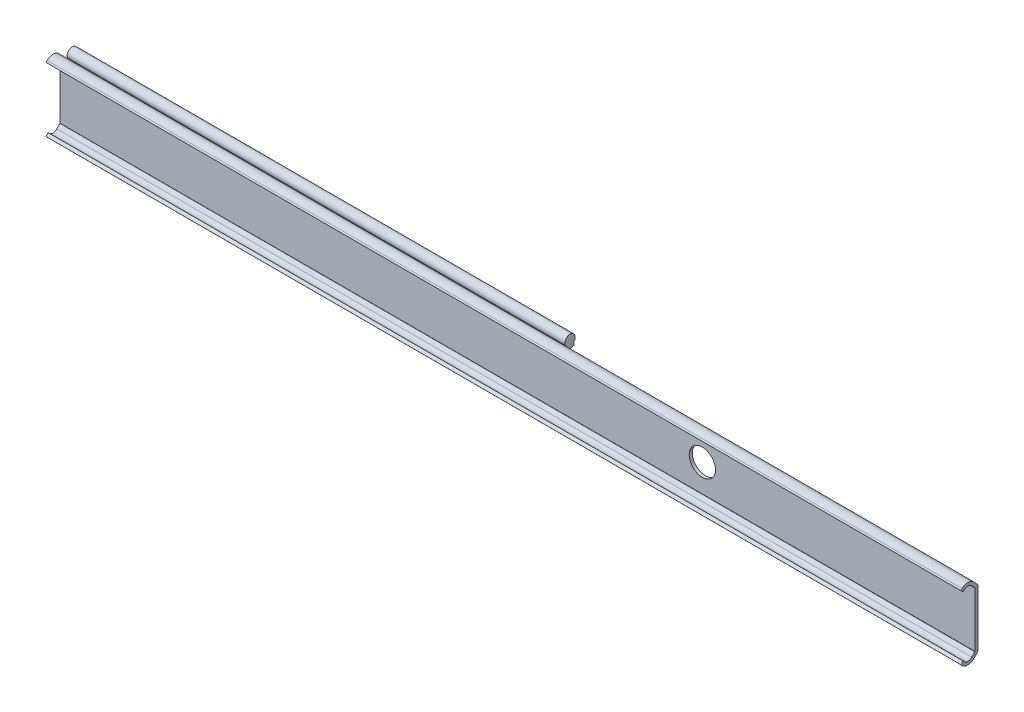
ISO-10303-21;
HEADER;
FILE_DESCRIPTION(('STEP AP214'),'2;1');
FILE_NAME('part.step','',(''),(''),'','','');
FILE_SCHEMA(('AUTOMOTIVE_DESIGN { 1 0 10303 214 1 1 1 1 }'));
ENDSEC;
DATA;
#1=APPLICATION_CONTEXT('core data for automotive mechanical design processes');
#2=APPLICATION_PROTOCOL_DEFINITION('international standard','automotive_design',2000,#1);
#3=PRODUCT_CONTEXT('',#1,'mechanical');
#4=PRODUCT('Part','Part','',(#3));
#5=PRODUCT_RELATED_PRODUCT_CATEGORY('part','',(#4));
#6=PRODUCT_DEFINITION_FORMATION('','',#4);
#7=PRODUCT_DEFINITION_CONTEXT('part definition',#1,'design');
#8=PRODUCT_DEFINITION('design','',#6,#7);
#9=PRODUCT_DEFINITION_SHAPE('','',#8);
#10=(LENGTH_UNIT() NAMED_UNIT(*) SI_UNIT(.MILLI.,.METRE.));
#11=(NAMED_UNIT(*) PLANE_ANGLE_UNIT() SI_UNIT($,.RADIAN.));
#12=(NAMED_UNIT(*) SI_UNIT($,.STERADIAN.) SOLID_ANGLE_UNIT());
#13=UNCERTAINTY_MEASURE_WITH_UNIT(LENGTH_MEASURE(1.E-05),#10,'distance_accuracy_value','');
#14=(GEOMETRIC_REPRESENTATION_CONTEXT(3) GLOBAL_UNCERTAINTY_ASSIGNED_CONTEXT((#13)) GLOBAL_UNIT_ASSIGNED_CONTEXT((#10,
#11,#12)) REPRESENTATION_CONTEXT('',''));
#15=CARTESIAN_POINT('',(0.,0.,0.));
#16=DIRECTION('',(0.,0.,1.));
#17=DIRECTION('',(1.,0.,0.));
#18=AXIS2_PLACEMENT_3D('',#15,#16,#17);
#19=CARTESIAN_POINT('',(0.,-13.5610180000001,0.));
#20=DIRECTION('',(0.,0.,-1.));
#21=DIRECTION('',(1.,0.,0.));
#22=AXIS2_PLACEMENT_3D('',#19,#20,#21);
#23=PLANE('',#22);
#24=CARTESIAN_POINT('',(318.2,0.,0.));
#25=DIRECTION('',(0.,0.,1.));
#26=DIRECTION('',(0.,-1.,0.));
#27=AXIS2_PLACEMENT_3D('',#24,#25,#26);
#28=CIRCLE('',#27,6.5);
#29=CARTESIAN_POINT('',(318.2,-6.50000000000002,0.));
#30=VERTEX_POINT('',#29);
#31=EDGE_CURVE('E9',#30,#30,#28,.T.);
#32=ORIENTED_EDGE('',*,*,#31,.T.);
#33=EDGE_LOOP('',(#32));
#34=FACE_BOUND('',#33,.T.);
#35=DIRECTION('',(0.,1.,0.));
#36=VECTOR('',#35,1.);
#37=CARTESIAN_POINT('',(0.,-13.5610180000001,0.));
#38=LINE('',#37,#36);
#39=CARTESIAN_POINT('',(0.,-13.5610180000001,0.));
#40=VERTEX_POINT('',#39);
#41=CARTESIAN_POINT('',(0.,-10.7622239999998,0.));
#42=VERTEX_POINT('',#41);
#43=EDGE_CURVE('E471',#40,#42,#38,.T.);
#44=ORIENTED_EDGE('',*,*,#43,.T.);
#45=DIRECTION('',(1.,0.,0.));
#46=VECTOR('',#45,1.);
#47=CARTESIAN_POINT('',(0.,-10.7622239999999,0.));
#48=LINE('',#47,#46);
#49=CARTESIAN_POINT('',(246.6,-10.7622239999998,0.));
#50=VERTEX_POINT('',#49);
#51=EDGE_CURVE('E23',#42,#50,#48,.T.);
#52=ORIENTED_EDGE('',*,*,#51,.T.);
#53=DIRECTION('',(0.,1.,0.));
#54=VECTOR('',#53,1.);
#55=CARTESIAN_POINT('',(246.6,-25.,0.));
#56=LINE('',#55,#54);
#57=CARTESIAN_POINT('',(246.6,10.7622239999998,0.));
#58=VERTEX_POINT('',#57);
#59=EDGE_CURVE('E302',#50,#58,#56,.T.);
#60=ORIENTED_EDGE('',*,*,#59,.T.);
#61=DIRECTION('',(1.,0.,0.));
#62=VECTOR('',#61,1.);
#63=CARTESIAN_POINT('',(0.,10.7622239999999,0.));
#64=LINE('',#63,#62);
#65=CARTESIAN_POINT('',(0.,10.7622239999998,0.));
#66=VERTEX_POINT('',#65);
#67=EDGE_CURVE('E31',#66,#58,#64,.T.);
#68=ORIENTED_EDGE('',*,*,#67,.F.);
#69=CARTESIAN_POINT('',(0.,13.561018,0.));
#70=VERTEX_POINT('',#69);
#71=EDGE_CURVE('E470',#66,#70,#38,.T.);
#72=ORIENTED_EDGE('',*,*,#71,.T.);
#73=DIRECTION('',(1.,0.,0.));
#74=VECTOR('',#73,1.);
#75=CARTESIAN_POINT('',(0.,13.561018,0.));
#76=LINE('',#75,#74);
#77=CARTESIAN_POINT('',(453.2,13.561018,0.));
#78=VERTEX_POINT('',#77);
#79=EDGE_CURVE('E482',#70,#78,#76,.T.);
#80=ORIENTED_EDGE('',*,*,#79,.T.);
#81=DIRECTION('',(0.,1.,0.));
#82=VECTOR('',#81,1.);
#83=CARTESIAN_POINT('',(453.2,-13.5610180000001,0.));
#84=LINE('',#83,#82);
#85=CARTESIAN_POINT('',(453.2,-13.5610180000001,0.));
#86=VERTEX_POINT('',#85);
#87=EDGE_CURVE('E410',#86,#78,#84,.T.);
#88=ORIENTED_EDGE('',*,*,#87,.F.);
#89=DIRECTION('',(1.,0.,0.));
#90=VECTOR('',#89,1.);
#91=CARTESIAN_POINT('',(0.,-13.5610180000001,0.));
#92=LINE('',#91,#90);
#93=EDGE_CURVE('E484',#40,#86,#92,.T.);
#94=ORIENTED_EDGE('',*,*,#93,.F.);
#95=EDGE_LOOP('',(#44,#52,#60,#68,#72,#80,#88,#94));
#96=FACE_BOUND('',#95,.T.);
#97=ADVANCED_FACE('F14',(#34,#96),#23,.T.);
#98=CARTESIAN_POINT('',(0.,-10.7622239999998,-1.66));
#99=DIRECTION('',(1.,0.,0.));
#100=DIRECTION('',(0.,0.,1.));
#101=AXIS2_PLACEMENT_3D('',#98,#99,#100);
#102=CYLINDRICAL_SURFACE('',#101,1.66);
#103=DIRECTION('',(1.,0.,0.));
#104=VECTOR('',#103,1.);
#105=CARTESIAN_POINT('',(0.,-12.2669175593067,-2.36106867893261));
#106=LINE('',#105,#104);
#107=CARTESIAN_POINT('',(0.,-12.2669175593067,-2.36106867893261));
#108=VERTEX_POINT('',#107);
#109=CARTESIAN_POINT('',(246.6,-12.2669175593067,-2.36106867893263));
#110=VERTEX_POINT('',#109);
#111=EDGE_CURVE('E264',#108,#110,#106,.T.);
#112=ORIENTED_EDGE('',*,*,#111,.T.);
#113=CARTESIAN_POINT('',(246.6,-10.7622239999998,-1.66));
#114=DIRECTION('',(-1.,0.,0.));
#115=DIRECTION('',(0.,0.,1.));
#116=AXIS2_PLACEMENT_3D('',#113,#114,#115);
#117=CIRCLE('',#116,1.66);
#118=EDGE_CURVE('E327',#50,#110,#117,.F.);
#119=ORIENTED_EDGE('',*,*,#118,.F.);
#120=ORIENTED_EDGE('',*,*,#51,.F.);
#121=CARTESIAN_POINT('',(0.,-10.7622239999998,-1.66));
#122=DIRECTION('',(1.,0.,0.));
#123=DIRECTION('',(0.,0.,-1.));
#124=AXIS2_PLACEMENT_3D('',#121,#122,#123);
#125=CIRCLE('',#124,1.65999999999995);
#126=EDGE_CURVE('E250',#42,#108,#125,.T.);
#127=ORIENTED_EDGE('',*,*,#126,.T.);
#128=EDGE_LOOP('',(#112,#119,#120,#127));
#129=FACE_BOUND('',#128,.T.);
#130=ADVANCED_FACE('F633',(#129),#102,.T.);
#131=CARTESIAN_POINT('',(0.,10.7622239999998,-1.66));
#132=DIRECTION('',(1.,0.,0.));
#133=DIRECTION('',(0.,0.,1.));
#134=AXIS2_PLACEMENT_3D('',#131,#132,#133);
#135=CYLINDRICAL_SURFACE('',#134,1.66);
#136=CARTESIAN_POINT('',(246.6,10.7622239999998,-1.66));
#137=DIRECTION('',(-1.,0.,0.));
#138=DIRECTION('',(0.,0.,1.));
#139=AXIS2_PLACEMENT_3D('',#136,#137,#138);
#140=CIRCLE('',#139,1.66);
#141=CARTESIAN_POINT('',(246.6,12.2669175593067,-2.36106867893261));
#142=VERTEX_POINT('',#141);
#143=EDGE_CURVE('E325',#142,#58,#140,.F.);
#144=ORIENTED_EDGE('',*,*,#143,.F.);
#145=DIRECTION('',(1.,0.,0.));
#146=VECTOR('',#145,1.);
#147=CARTESIAN_POINT('',(0.,12.2669175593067,-2.36106867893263));
#148=LINE('',#147,#146);
#149=CARTESIAN_POINT('',(0.,12.2669175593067,-2.36106867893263));
#150=VERTEX_POINT('',#149);
#151=EDGE_CURVE('E303',#150,#142,#148,.T.);
#152=ORIENTED_EDGE('',*,*,#151,.F.);
#153=CARTESIAN_POINT('',(0.,10.7622239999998,-1.66));
#154=DIRECTION('',(1.,0.,0.));
#155=DIRECTION('',(0.,0.,-1.));
#156=AXIS2_PLACEMENT_3D('',#153,#154,#155);
#157=CIRCLE('',#156,1.65999999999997);
#158=EDGE_CURVE('E296',#150,#66,#157,.T.);
#159=ORIENTED_EDGE('',*,*,#158,.T.);
#160=ORIENTED_EDGE('',*,*,#67,.T.);
#161=EDGE_LOOP('',(#144,#152,#159,#160));
#162=FACE_BOUND('',#161,.T.);
#163=ADVANCED_FACE('F597',(#162),#135,.T.);
#164=CARTESIAN_POINT('',(0.,11.8784795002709,-5.98462837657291));
#165=DIRECTION('',(0.,0.60181512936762,-0.798635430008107));
#166=DIRECTION('',(0.,0.798635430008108,0.60181512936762));
#167=AXIS2_PLACEMENT_3D('',#164,#165,#166);
#168=PLANE('',#167);
#169=DIRECTION('',(1.,0.,0.));
#170=VECTOR('',#169,1.);
#171=CARTESIAN_POINT('',(0.,11.6159967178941,-6.18242339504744));
#172=LINE('',#171,#170);
#173=CARTESIAN_POINT('',(0.,11.6159967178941,-6.18242339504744));
#174=VERTEX_POINT('',#173);
#175=CARTESIAN_POINT('',(246.6,11.6159967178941,-6.18242339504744));
#176=VERTEX_POINT('',#175);
#177=EDGE_CURVE('E249',#174,#176,#172,.T.);
#178=ORIENTED_EDGE('',*,*,#177,.T.);
#179=DIRECTION('',(0.,0.798635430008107,0.60181512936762));
#180=VECTOR('',#179,1.);
#181=CARTESIAN_POINT('',(246.6,11.8784795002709,-5.98462837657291));
#182=LINE('',#181,#180);
#183=CARTESIAN_POINT('',(246.6,11.0618539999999,-6.6));
#184=VERTEX_POINT('',#183);
#185=EDGE_CURVE('E322',#184,#176,#182,.T.);
#186=ORIENTED_EDGE('',*,*,#185,.F.);
#187=DIRECTION('',(1.,0.,0.));
#188=VECTOR('',#187,1.);
#189=CARTESIAN_POINT('',(0.,11.0618539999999,-6.6));
#190=LINE('',#189,#188);
#191=CARTESIAN_POINT('',(0.,11.0618539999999,-6.6));
#192=VERTEX_POINT('',#191);
#193=EDGE_CURVE('E333',#192,#184,#190,.T.);
#194=ORIENTED_EDGE('',*,*,#193,.F.);
#195=DIRECTION('',(0.,0.798635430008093,0.601815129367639));
#196=VECTOR('',#195,1.);
#197=CARTESIAN_POINT('',(0.,11.0618539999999,-6.6));
#198=LINE('',#197,#196);
#199=EDGE_CURVE('E290',#192,#174,#198,.T.);
#200=ORIENTED_EDGE('',*,*,#199,.T.);
#201=EDGE_LOOP('',(#178,#186,#194,#200));
#202=FACE_BOUND('',#201,.T.);
#203=ADVANCED_FACE('F604',(#202),#168,.T.);
#204=CARTESIAN_POINT('',(0.,11.0618539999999,-6.6));
#205=DIRECTION('',(0.,0.,-1.));
#206=DIRECTION('',(1.,0.,0.));
#207=AXIS2_PLACEMENT_3D('',#204,#205,#206);
#208=PLANE('',#207);
#209=DIRECTION('',(0.,1.,0.));
#210=VECTOR('',#209,1.);
#211=CARTESIAN_POINT('',(246.6,11.0618539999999,-6.6));
#212=LINE('',#211,#210);
#213=CARTESIAN_POINT('',(246.6,10.4239399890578,-6.6));
#214=VERTEX_POINT('',#213);
#215=EDGE_CURVE('E320',#214,#184,#212,.T.);
#216=ORIENTED_EDGE('',*,*,#215,.F.);
#217=DIRECTION('',(1.,0.,0.));
#218=VECTOR('',#217,1.);
#219=CARTESIAN_POINT('',(0.,10.4239399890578,-6.6));
#220=LINE('',#219,#218);
#221=CARTESIAN_POINT('',(0.,10.4239399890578,-6.6));
#222=VERTEX_POINT('',#221);
#223=EDGE_CURVE('E336',#222,#214,#220,.T.);
#224=ORIENTED_EDGE('',*,*,#223,.F.);
#225=DIRECTION('',(0.,1.,0.));
#226=VECTOR('',#225,1.);
#227=CARTESIAN_POINT('',(0.,10.4239399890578,-6.6));
#228=LINE('',#227,#226);
#229=EDGE_CURVE('E287',#222,#192,#228,.T.);
#230=ORIENTED_EDGE('',*,*,#229,.T.);
#231=ORIENTED_EDGE('',*,*,#193,.T.);
#232=EDGE_LOOP('',(#216,#224,#230,#231));
#233=FACE_BOUND('',#232,.T.);
#234=ADVANCED_FACE('F608',(#233),#208,.T.);
#235=CARTESIAN_POINT('',(0.,13.915,-4.44999999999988));
#236=DIRECTION('',(1.,0.,0.));
#237=DIRECTION('',(0.,0.,1.));
#238=AXIS2_PLACEMENT_3D('',#235,#236,#237);
#239=CYLINDRICAL_SURFACE('',#238,4.1);
#240=CARTESIAN_POINT('',(246.6,13.915,-4.44999999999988));
#241=DIRECTION('',(-1.,0.,0.));
#242=DIRECTION('',(0.,0.,1.));
#243=AXIS2_PLACEMENT_3D('',#240,#241,#242);
#244=CIRCLE('',#243,4.1);
#245=CARTESIAN_POINT('',(246.6,10.8444026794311,-1.73312089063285));
#246=VERTEX_POINT('',#245);
#247=EDGE_CURVE('E318',#246,#214,#244,.F.);
#248=ORIENTED_EDGE('',*,*,#247,.F.);
#249=DIRECTION('',(1.,0.,0.));
#250=VECTOR('',#249,1.);
#251=CARTESIAN_POINT('',(0.,10.8444026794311,-1.73312089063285));
#252=LINE('',#251,#250);
#253=CARTESIAN_POINT('',(0.,10.8444026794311,-1.73312089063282));
#254=VERTEX_POINT('',#253);
#255=EDGE_CURVE('E339',#254,#246,#252,.T.);
#256=ORIENTED_EDGE('',*,*,#255,.F.);
#257=CARTESIAN_POINT('',(0.,13.915,-4.44999999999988));
#258=DIRECTION('',(1.,0.,0.));
#259=DIRECTION('',(0.,0.,-1.));
#260=AXIS2_PLACEMENT_3D('',#257,#258,#259);
#261=CIRCLE('',#260,4.1);
#262=EDGE_CURVE('E284',#254,#222,#261,.T.);
#263=ORIENTED_EDGE('',*,*,#262,.T.);
#264=ORIENTED_EDGE('',*,*,#223,.T.);
#265=EDGE_LOOP('',(#248,#256,#263,#264));
#266=FACE_BOUND('',#265,.T.);
#267=ADVANCED_FACE('F613',(#266),#239,.T.);
#268=CARTESIAN_POINT('',(0.,10.7622239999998,-1.66));
#269=DIRECTION('',(1.,0.,0.));
#270=DIRECTION('',(0.,0.,1.));
#271=AXIS2_PLACEMENT_3D('',#268,#269,#270);
#272=CYLINDRICAL_SURFACE('',#271,0.110000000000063);
#273=CARTESIAN_POINT('',(246.6,10.7622239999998,-1.66));
#274=DIRECTION('',(-1.,0.,0.));
#275=DIRECTION('',(0.,0.,1.));
#276=AXIS2_PLACEMENT_3D('',#273,#274,#275);
#277=CIRCLE('',#276,0.110000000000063);
#278=CARTESIAN_POINT('',(246.6,10.7622239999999,-1.55));
#279=VERTEX_POINT('',#278);
#280=EDGE_CURVE('E316',#279,#246,#277,.T.);
#281=ORIENTED_EDGE('',*,*,#280,.F.);
#282=DIRECTION('',(1.,0.,0.));
#283=VECTOR('',#282,1.);
#284=CARTESIAN_POINT('',(0.,10.7622239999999,-1.55));
#285=LINE('',#284,#283);
#286=CARTESIAN_POINT('',(0.,10.7622239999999,-1.55));
#287=VERTEX_POINT('',#286);
#288=EDGE_CURVE('E342',#287,#279,#285,.T.);
#289=ORIENTED_EDGE('',*,*,#288,.F.);
#290=CARTESIAN_POINT('',(0.,10.7622239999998,-1.66));
#291=DIRECTION('',(-1.,0.,0.));
#292=DIRECTION('',(0.,0.,-1.));
#293=AXIS2_PLACEMENT_3D('',#290,#291,#292);
#294=CIRCLE('',#293,0.110000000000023);
#295=EDGE_CURVE('E281',#287,#254,#294,.T.);
#296=ORIENTED_EDGE('',*,*,#295,.T.);
#297=ORIENTED_EDGE('',*,*,#255,.T.);
#298=EDGE_LOOP('',(#281,#289,#296,#297));
#299=FACE_BOUND('',#298,.T.);
#300=ADVANCED_FACE('F616',(#299),#272,.F.);
#301=CARTESIAN_POINT('',(0.,-10.7622239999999,-1.55));
#302=DIRECTION('',(0.,0.,-1.));
#303=DIRECTION('',(1.,0.,0.));
#304=AXIS2_PLACEMENT_3D('',#301,#302,#303);
#305=PLANE('',#304);
#306=DIRECTION('',(0.,1.,0.));
#307=VECTOR('',#306,1.);
#308=CARTESIAN_POINT('',(246.6,-10.7622239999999,-1.55));
#309=LINE('',#308,#307);
#310=CARTESIAN_POINT('',(246.6,-10.7622239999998,-1.54999999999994));
#311=VERTEX_POINT('',#310);
#312=EDGE_CURVE('E314',#311,#279,#309,.T.);
#313=ORIENTED_EDGE('',*,*,#312,.F.);
#314=DIRECTION('',(1.,0.,0.));
#315=VECTOR('',#314,1.);
#316=CARTESIAN_POINT('',(0.,-10.7622239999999,-1.55));
#317=LINE('',#316,#315);
#318=CARTESIAN_POINT('',(0.,-10.7622239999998,-1.55));
#319=VERTEX_POINT('',#318);
#320=EDGE_CURVE('E345',#319,#311,#317,.T.);
#321=ORIENTED_EDGE('',*,*,#320,.F.);
#322=DIRECTION('',(0.,1.,0.));
#323=VECTOR('',#322,1.);
#324=CARTESIAN_POINT('',(0.,-10.7622239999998,-1.54999999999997));
#325=LINE('',#324,#323);
#326=EDGE_CURVE('E278',#319,#287,#325,.T.);
#327=ORIENTED_EDGE('',*,*,#326,.T.);
#328=ORIENTED_EDGE('',*,*,#288,.T.);
#329=EDGE_LOOP('',(#313,#321,#327,#328));
#330=FACE_BOUND('',#329,.T.);
#331=ADVANCED_FACE('F621',(#330),#305,.T.);
#332=CARTESIAN_POINT('',(0.,-10.7622239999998,-1.66));
#333=DIRECTION('',(1.,0.,0.));
#334=DIRECTION('',(0.,0.,1.));
#335=AXIS2_PLACEMENT_3D('',#332,#333,#334);
#336=CYLINDRICAL_SURFACE('',#335,0.110000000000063);
#337=CARTESIAN_POINT('',(246.6,-10.7622239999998,-1.66));
#338=DIRECTION('',(-1.,0.,0.));
#339=DIRECTION('',(0.,0.,1.));
#340=AXIS2_PLACEMENT_3D('',#337,#338,#339);
#341=CIRCLE('',#340,0.110000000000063);
#342=CARTESIAN_POINT('',(246.6,-10.8444026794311,-1.73312089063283));
#343=VERTEX_POINT('',#342);
#344=EDGE_CURVE('E312',#343,#311,#341,.T.);
#345=ORIENTED_EDGE('',*,*,#344,.F.);
#346=DIRECTION('',(1.,0.,0.));
#347=VECTOR('',#346,1.);
#348=CARTESIAN_POINT('',(0.,-10.8444026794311,-1.73312089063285));
#349=LINE('',#348,#347);
#350=CARTESIAN_POINT('',(0.,-10.8444026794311,-1.73312089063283));
#351=VERTEX_POINT('',#350);
#352=EDGE_CURVE('E348',#351,#343,#349,.T.);
#353=ORIENTED_EDGE('',*,*,#352,.F.);
#354=CARTESIAN_POINT('',(0.,-10.7622239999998,-1.66));
#355=DIRECTION('',(-1.,0.,0.));
#356=DIRECTION('',(0.,0.,-1.));
#357=AXIS2_PLACEMENT_3D('',#354,#355,#356);
#358=CIRCLE('',#357,0.11000000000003);
#359=EDGE_CURVE('E275',#351,#319,#358,.T.);
#360=ORIENTED_EDGE('',*,*,#359,.T.);
#361=ORIENTED_EDGE('',*,*,#320,.T.);
#362=EDGE_LOOP('',(#345,#353,#360,#361));
#363=FACE_BOUND('',#362,.T.);
#364=ADVANCED_FACE('F624',(#363),#336,.F.);
#365=CARTESIAN_POINT('',(0.,-13.915,-4.44999999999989));
#366=DIRECTION('',(1.,0.,0.));
#367=DIRECTION('',(0.,0.,1.));
#368=AXIS2_PLACEMENT_3D('',#365,#366,#367);
#369=CYLINDRICAL_SURFACE('',#368,4.1);
#370=CARTESIAN_POINT('',(246.6,-13.915,-4.44999999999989));
#371=DIRECTION('',(-1.,0.,0.));
#372=DIRECTION('',(0.,0.,1.));
#373=AXIS2_PLACEMENT_3D('',#370,#371,#372);
#374=CIRCLE('',#373,4.1);
#375=CARTESIAN_POINT('',(246.6,-10.4239399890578,-6.6));
#376=VERTEX_POINT('',#375);
#377=EDGE_CURVE('E310',#376,#343,#374,.F.);
#378=ORIENTED_EDGE('',*,*,#377,.F.);
#379=DIRECTION('',(1.,0.,0.));
#380=VECTOR('',#379,1.);
#381=CARTESIAN_POINT('',(0.,-10.4239399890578,-6.6));
#382=LINE('',#381,#380);
#383=CARTESIAN_POINT('',(0.,-10.4239399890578,-6.6));
#384=VERTEX_POINT('',#383);
#385=EDGE_CURVE('E351',#384,#376,#382,.T.);
#386=ORIENTED_EDGE('',*,*,#385,.F.);
#387=CARTESIAN_POINT('',(0.,-13.915,-4.44999999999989));
#388=DIRECTION('',(1.,0.,0.));
#389=DIRECTION('',(0.,0.,-1.));
#390=AXIS2_PLACEMENT_3D('',#387,#388,#389);
#391=CIRCLE('',#390,4.1);
#392=EDGE_CURVE('E272',#384,#351,#391,.T.);
#393=ORIENTED_EDGE('',*,*,#392,.T.);
#394=ORIENTED_EDGE('',*,*,#352,.T.);
#395=EDGE_LOOP('',(#378,#386,#393,#394));
#396=FACE_BOUND('',#395,.T.);
#397=ADVANCED_FACE('F627',(#396),#369,.T.);
#398=CARTESIAN_POINT('',(0.,-11.0618539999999,-6.6));
#399=DIRECTION('',(0.,0.,-1.));
#400=DIRECTION('',(1.,0.,0.));
#401=AXIS2_PLACEMENT_3D('',#398,#399,#400);
#402=PLANE('',#401);
#403=DIRECTION('',(0.,1.,0.));
#404=VECTOR('',#403,1.);
#405=CARTESIAN_POINT('',(246.6,-11.0618539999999,-6.6));
#406=LINE('',#405,#404);
#407=CARTESIAN_POINT('',(246.6,-11.0618539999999,-6.6));
#408=VERTEX_POINT('',#407);
#409=EDGE_CURVE('E308',#408,#376,#406,.T.);
#410=ORIENTED_EDGE('',*,*,#409,.F.);
#411=DIRECTION('',(1.,0.,0.));
#412=VECTOR('',#411,1.);
#413=CARTESIAN_POINT('',(0.,-11.0618539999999,-6.6));
#414=LINE('',#413,#412);
#415=CARTESIAN_POINT('',(0.,-11.0618539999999,-6.6));
#416=VERTEX_POINT('',#415);
#417=EDGE_CURVE('E354',#416,#408,#414,.T.);
#418=ORIENTED_EDGE('',*,*,#417,.F.);
#419=DIRECTION('',(0.,1.,0.));
#420=VECTOR('',#419,1.);
#421=CARTESIAN_POINT('',(0.,-11.0618539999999,-6.6));
#422=LINE('',#421,#420);
#423=EDGE_CURVE('E261',#416,#384,#422,.T.);
#424=ORIENTED_EDGE('',*,*,#423,.T.);
#425=ORIENTED_EDGE('',*,*,#385,.T.);
#426=EDGE_LOOP('',(#410,#418,#424,#425));
#427=FACE_BOUND('',#426,.T.);
#428=ADVANCED_FACE('F630',(#427),#402,.T.);
#429=CARTESIAN_POINT('',(0.,-11.8784795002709,-5.98462837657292));
#430=DIRECTION('',(0.,-0.60181512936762,-0.798635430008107));
#431=DIRECTION('',(0.,0.798635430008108,-0.60181512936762));
#432=AXIS2_PLACEMENT_3D('',#429,#430,#431);
#433=PLANE('',#432);
#434=DIRECTION('',(0.,0.798635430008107,-0.60181512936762));
#435=VECTOR('',#434,1.);
#436=CARTESIAN_POINT('',(246.6,-11.8784795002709,-5.98462837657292));
#437=LINE('',#436,#435);
#438=CARTESIAN_POINT('',(246.6,-11.6159967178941,-6.18242339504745));
#439=VERTEX_POINT('',#438);
#440=EDGE_CURVE('E244',#439,#408,#437,.T.);
#441=ORIENTED_EDGE('',*,*,#440,.F.);
#442=DIRECTION('',(1.,0.,0.));
#443=VECTOR('',#442,1.);
#444=CARTESIAN_POINT('',(0.,-11.6159967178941,-6.18242339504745));
#445=LINE('',#444,#443);
#446=CARTESIAN_POINT('',(0.,-11.6159967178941,-6.18242339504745));
#447=VERTEX_POINT('',#446);
#448=EDGE_CURVE('E239',#447,#439,#445,.T.);
#449=ORIENTED_EDGE('',*,*,#448,.F.);
#450=DIRECTION('',(0.,0.798635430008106,-0.601815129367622));
#451=VECTOR('',#450,1.);
#452=CARTESIAN_POINT('',(0.,-11.6159967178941,-6.18242339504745));
#453=LINE('',#452,#451);
#454=EDGE_CURVE('E243',#447,#416,#453,.T.);
#455=ORIENTED_EDGE('',*,*,#454,.T.);
#456=ORIENTED_EDGE('',*,*,#417,.T.);
#457=EDGE_LOOP('',(#441,#449,#455,#456));
#458=FACE_BOUND('',#457,.T.);
#459=ADVANCED_FACE('F241',(#458),#433,.T.);
#460=CARTESIAN_POINT('',(0.,-13.915,-4.44999999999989));
#461=DIRECTION('',(-1.,0.,0.));
#462=DIRECTION('',(0.,0.,-1.));
#463=AXIS2_PLACEMENT_3D('',#460,#461,#462);
#464=PLANE('',#463);
#465=CARTESIAN_POINT('',(0.,13.561018,1.8));
#466=DIRECTION('',(1.,0.,0.));
#467=DIRECTION('',(0.,0.,-1.));
#468=AXIS2_PLACEMENT_3D('',#465,#466,#467);
#469=CIRCLE('',#468,1.8);
#470=CARTESIAN_POINT('',(0.,14.8073560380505,0.501292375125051));
#471=VERTEX_POINT('',#470);
#472=EDGE_CURVE('E473',#70,#471,#469,.T.);
#473=ORIENTED_EDGE('',*,*,#472,.F.);
#474=ORIENTED_EDGE('',*,*,#71,.F.);
#475=ORIENTED_EDGE('',*,*,#158,.F.);
#476=CARTESIAN_POINT('',(0.,13.575,-4.55));
#477=DIRECTION('',(1.,0.,0.));
#478=DIRECTION('',(0.,0.,-1.));
#479=AXIS2_PLACEMENT_3D('',#476,#477,#478);
#480=CIRCLE('',#479,2.55);
#481=EDGE_CURVE('E293',#174,#150,#480,.T.);
#482=ORIENTED_EDGE('',*,*,#481,.F.);
#483=ORIENTED_EDGE('',*,*,#199,.F.);
#484=ORIENTED_EDGE('',*,*,#229,.F.);
#485=ORIENTED_EDGE('',*,*,#262,.F.);
#486=ORIENTED_EDGE('',*,*,#295,.F.);
#487=ORIENTED_EDGE('',*,*,#326,.F.);
#488=ORIENTED_EDGE('',*,*,#359,.F.);
#489=ORIENTED_EDGE('',*,*,#392,.F.);
#490=ORIENTED_EDGE('',*,*,#423,.F.);
#491=ORIENTED_EDGE('',*,*,#454,.F.);
#492=CARTESIAN_POINT('',(0.,-13.575,-4.55));
#493=DIRECTION('',(1.,0.,0.));
#494=DIRECTION('',(0.,0.,1.));
#495=AXIS2_PLACEMENT_3D('',#492,#493,#494);
#496=CIRCLE('',#495,2.55);
#497=EDGE_CURVE('E258',#108,#447,#496,.T.);
#498=ORIENTED_EDGE('',*,*,#497,.F.);
#499=ORIENTED_EDGE('',*,*,#126,.F.);
#500=ORIENTED_EDGE('',*,*,#43,.F.);
#501=CARTESIAN_POINT('',(0.,-13.561018,1.8));
#502=DIRECTION('',(1.,0.,0.));
#503=DIRECTION('',(0.,0.,1.));
#504=AXIS2_PLACEMENT_3D('',#501,#502,#503);
#505=CIRCLE('',#504,1.8);
#506=CARTESIAN_POINT('',(0.,-14.8073560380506,0.50129237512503));
#507=VERTEX_POINT('',#506);
#508=EDGE_CURVE('E467',#507,#40,#505,.T.);
#509=ORIENTED_EDGE('',*,*,#508,.F.);
#510=DIRECTION('',(0.,0.721504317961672,-0.692409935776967));
#511=VECTOR('',#510,1.);
#512=CARTESIAN_POINT('',(0.,-14.8073560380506,0.50129237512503));
#513=LINE('',#512,#511);
#514=CARTESIAN_POINT('',(0.,-16.4741282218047,2.10085261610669));
#515=VERTEX_POINT('',#514);
#516=EDGE_CURVE('E464',#515,#507,#513,.T.);
#517=ORIENTED_EDGE('',*,*,#516,.F.);
#518=CARTESIAN_POINT('',(0.,-13.5750000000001,5.));
#519=DIRECTION('',(1.,0.,0.));
#520=DIRECTION('',(0.,0.,1.));
#521=AXIS2_PLACEMENT_3D('',#518,#519,#520);
#522=CIRCLE('',#521,4.1);
#523=CARTESIAN_POINT('',(0.,-16.4741282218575,7.89914738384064));
#524=VERTEX_POINT('',#523);
#525=EDGE_CURVE('E461',#524,#515,#522,.T.);
#526=ORIENTED_EDGE('',*,*,#525,.F.);
#527=DIRECTION('',(0.,-0.721504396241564,-0.692409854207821));
#528=VECTOR('',#527,1.);
#529=CARTESIAN_POINT('',(0.,-15.8897090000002,8.46));
#530=LINE('',#529,#528);
#531=CARTESIAN_POINT('',(0.,-15.8897090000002,8.46));
#532=VERTEX_POINT('',#531);
#533=EDGE_CURVE('E458',#532,#524,#530,.T.);
#534=ORIENTED_EDGE('',*,*,#533,.F.);
#535=DIRECTION('',(0.,-0.707106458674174,0.707107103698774));
#536=VECTOR('',#535,1.);
#537=CARTESIAN_POINT('',(0.,-14.7934620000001,7.363752));
#538=LINE('',#537,#536);
#539=CARTESIAN_POINT('',(0.,-14.7934620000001,7.363752));
#540=VERTEX_POINT('',#539);
#541=EDGE_CURVE('E455',#540,#532,#538,.T.);
#542=ORIENTED_EDGE('',*,*,#541,.F.);
#543=DIRECTION('',(0.,0.721503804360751,0.692410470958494));
#544=VECTOR('',#543,1.);
#545=CARTESIAN_POINT('',(0.,-15.3880487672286,6.79314086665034));
#546=LINE('',#545,#544);
#547=CARTESIAN_POINT('',(0.,-15.3880487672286,6.79314086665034));
#548=VERTEX_POINT('',#547);
#549=EDGE_CURVE('E452',#548,#540,#546,.T.);
#550=ORIENTED_EDGE('',*,*,#549,.F.);
#551=CARTESIAN_POINT('',(0.,-13.5750000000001,5.));
#552=DIRECTION('',(-1.,0.,0.));
#553=DIRECTION('',(0.,0.,-1.));
#554=AXIS2_PLACEMENT_3D('',#551,#552,#553);
#555=CIRCLE('',#554,2.55);
#556=CARTESIAN_POINT('',(0.,-15.2920682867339,3.11474762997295));
#557=VERTEX_POINT('',#556);
#558=EDGE_CURVE('E449',#557,#548,#555,.T.);
#559=ORIENTED_EDGE('',*,*,#558,.F.);
#560=DIRECTION('',(0.,-0.721504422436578,0.692409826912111));
#561=VECTOR('',#560,1.);
#562=CARTESIAN_POINT('',(0.,-13.734120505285,1.61962394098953));
#563=LINE('',#562,#561);
#564=CARTESIAN_POINT('',(0.,-13.734120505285,1.61962394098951));
#565=VERTEX_POINT('',#564);
#566=EDGE_CURVE('E446',#565,#557,#563,.T.);
#567=ORIENTED_EDGE('',*,*,#566,.F.);
#568=CARTESIAN_POINT('',(0.,-13.561018,1.8));
#569=DIRECTION('',(-1.,0.,0.));
#570=DIRECTION('',(0.,0.,-1.));
#571=AXIS2_PLACEMENT_3D('',#568,#569,#570);
#572=CIRCLE('',#571,0.250000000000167);
#573=CARTESIAN_POINT('',(0.,-13.5610180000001,1.54999999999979));
#574=VERTEX_POINT('',#573);
#575=EDGE_CURVE('E443',#574,#565,#572,.T.);
#576=ORIENTED_EDGE('',*,*,#575,.F.);
#577=DIRECTION('',(0.,-1.,0.));
#578=VECTOR('',#577,1.);
#579=CARTESIAN_POINT('',(0.,13.561018,1.54999999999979));
#580=LINE('',#579,#578);
#581=CARTESIAN_POINT('',(0.,13.561018,1.54999999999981));
#582=VERTEX_POINT('',#581);
#583=EDGE_CURVE('E440',#582,#574,#580,.T.);
#584=ORIENTED_EDGE('',*,*,#583,.F.);
#585=CARTESIAN_POINT('',(0.,13.561018,1.8));
#586=DIRECTION('',(-1.,0.,0.));
#587=DIRECTION('',(0.,0.,1.));
#588=AXIS2_PLACEMENT_3D('',#585,#586,#587);
#589=CIRCLE('',#588,0.250000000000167);
#590=CARTESIAN_POINT('',(0.,13.7341205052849,1.61962394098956));
#591=VERTEX_POINT('',#590);
#592=EDGE_CURVE('E437',#591,#582,#589,.T.);
#593=ORIENTED_EDGE('',*,*,#592,.F.);
#594=DIRECTION('',(0.,-0.721504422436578,-0.692409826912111));
#595=VECTOR('',#594,1.);
#596=CARTESIAN_POINT('',(0.,13.7341205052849,1.61962394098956));
#597=LINE('',#596,#595);
#598=CARTESIAN_POINT('',(0.,15.2920682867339,3.11474762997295));
#599=VERTEX_POINT('',#598);
#600=EDGE_CURVE('E434',#599,#591,#597,.T.);
#601=ORIENTED_EDGE('',*,*,#600,.F.);
#602=CARTESIAN_POINT('',(0.,13.575,5.));
#603=DIRECTION('',(-1.,0.,0.));
#604=DIRECTION('',(0.,0.,1.));
#605=AXIS2_PLACEMENT_3D('',#602,#603,#604);
#606=CIRCLE('',#605,2.55);
#607=CARTESIAN_POINT('',(0.,15.3880487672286,6.79314086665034));
#608=VERTEX_POINT('',#607);
#609=EDGE_CURVE('E431',#608,#599,#606,.T.);
#610=ORIENTED_EDGE('',*,*,#609,.F.);
#611=DIRECTION('',(0.,0.721503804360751,-0.692410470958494));
#612=VECTOR('',#611,1.);
#613=CARTESIAN_POINT('',(0.,15.3880487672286,6.79314086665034));
#614=LINE('',#613,#612);
#615=CARTESIAN_POINT('',(0.,14.7934620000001,7.363752));
#616=VERTEX_POINT('',#615);
#617=EDGE_CURVE('E428',#616,#608,#614,.T.);
#618=ORIENTED_EDGE('',*,*,#617,.F.);
#619=DIRECTION('',(0.,-0.707106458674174,-0.707107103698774));
#620=VECTOR('',#619,1.);
#621=CARTESIAN_POINT('',(0.,14.7934620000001,7.363752));
#622=LINE('',#621,#620);
#623=CARTESIAN_POINT('',(0.,15.8897090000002,8.46));
#624=VERTEX_POINT('',#623);
#625=EDGE_CURVE('E425',#624,#616,#622,.T.);
#626=ORIENTED_EDGE('',*,*,#625,.F.);
#627=DIRECTION('',(0.,-0.721504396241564,0.692409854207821));
#628=VECTOR('',#627,1.);
#629=CARTESIAN_POINT('',(0.,15.8897090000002,8.46));
#630=LINE('',#629,#628);
#631=CARTESIAN_POINT('',(0.,16.4741282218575,7.89914738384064));
#632=VERTEX_POINT('',#631);
#633=EDGE_CURVE('E422',#632,#624,#630,.T.);
#634=ORIENTED_EDGE('',*,*,#633,.F.);
#635=CARTESIAN_POINT('',(0.,13.575,5.));
#636=DIRECTION('',(1.,0.,0.));
#637=DIRECTION('',(0.,0.,-1.));
#638=AXIS2_PLACEMENT_3D('',#635,#636,#637);
#639=CIRCLE('',#638,4.1);
#640=CARTESIAN_POINT('',(0.,16.4741282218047,2.10085261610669));
#641=VERTEX_POINT('',#640);
#642=EDGE_CURVE('E419',#641,#632,#639,.T.);
#643=ORIENTED_EDGE('',*,*,#642,.F.);
#644=DIRECTION('',(0.,0.721504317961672,0.692409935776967));
#645=VECTOR('',#644,1.);
#646=CARTESIAN_POINT('',(0.,14.8073560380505,0.501292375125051));
#647=LINE('',#646,#645);
#648=EDGE_CURVE('E476',#471,#641,#647,.T.);
#649=ORIENTED_EDGE('',*,*,#648,.F.);
#650=EDGE_LOOP('',(#473,#474,#475,#482,#483,#484,#485,#486,#487,#488,#489,#490,#491,#498,#499,
#500,#509,#517,#526,#534,#542,#550,#559,#567,#576,#584,#593,#601,#610,#618,#626,#634,#643,#649));
#651=FACE_BOUND('',#650,.T.);
#652=ADVANCED_FACE('F256',(#651),#464,.T.);
#653=CARTESIAN_POINT('',(453.2,-13.915,-4.44999999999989));
#654=DIRECTION('',(-1.,0.,0.));
#655=DIRECTION('',(0.,0.,-1.));
#656=AXIS2_PLACEMENT_3D('',#653,#654,#655);
#657=PLANE('',#656);
#658=ORIENTED_EDGE('',*,*,#87,.T.);
#659=CARTESIAN_POINT('',(453.2,13.561018,1.8));
#660=DIRECTION('',(1.,0.,0.));
#661=DIRECTION('',(0.,0.,-1.));
#662=AXIS2_PLACEMENT_3D('',#659,#660,#661);
#663=CIRCLE('',#662,1.8);
#664=CARTESIAN_POINT('',(453.2,14.8073560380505,0.501292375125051));
#665=VERTEX_POINT('',#664);
#666=EDGE_CURVE('E413',#78,#665,#663,.T.);
#667=ORIENTED_EDGE('',*,*,#666,.T.);
#668=DIRECTION('',(0.,0.721504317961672,0.692409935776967));
#669=VECTOR('',#668,1.);
#670=CARTESIAN_POINT('',(453.2,14.8073560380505,0.501292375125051));
#671=LINE('',#670,#669);
#672=CARTESIAN_POINT('',(453.2,16.4741282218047,2.10085261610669));
#673=VERTEX_POINT('',#672);
#674=EDGE_CURVE('E416',#665,#673,#671,.T.);
#675=ORIENTED_EDGE('',*,*,#674,.T.);
#676=CARTESIAN_POINT('',(453.2,13.575,5.));
#677=DIRECTION('',(1.,0.,0.));
#678=DIRECTION('',(0.,0.,-1.));
#679=AXIS2_PLACEMENT_3D('',#676,#677,#678);
#680=CIRCLE('',#679,4.1);
#681=CARTESIAN_POINT('',(453.2,16.4741282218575,7.89914738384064));
#682=VERTEX_POINT('',#681);
#683=EDGE_CURVE('E359',#673,#682,#680,.T.);
#684=ORIENTED_EDGE('',*,*,#683,.T.);
#685=DIRECTION('',(0.,-0.721504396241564,0.692409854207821));
#686=VECTOR('',#685,1.);
#687=CARTESIAN_POINT('',(453.2,15.8897090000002,8.46));
#688=LINE('',#687,#686);
#689=CARTESIAN_POINT('',(453.2,15.8897090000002,8.46));
#690=VERTEX_POINT('',#689);
#691=EDGE_CURVE('E362',#682,#690,#688,.T.);
#692=ORIENTED_EDGE('',*,*,#691,.T.);
#693=DIRECTION('',(0.,-0.707106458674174,-0.707107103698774));
#694=VECTOR('',#693,1.);
#695=CARTESIAN_POINT('',(453.2,14.7934620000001,7.363752));
#696=LINE('',#695,#694);
#697=CARTESIAN_POINT('',(453.2,14.7934620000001,7.363752));
#698=VERTEX_POINT('',#697);
#699=EDGE_CURVE('E365',#690,#698,#696,.T.);
#700=ORIENTED_EDGE('',*,*,#699,.T.);
#701=DIRECTION('',(0.,0.721503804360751,-0.692410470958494));
#702=VECTOR('',#701,1.);
#703=CARTESIAN_POINT('',(453.2,15.3880487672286,6.79314086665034));
#704=LINE('',#703,#702);
#705=CARTESIAN_POINT('',(453.2,15.3880487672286,6.79314086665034));
#706=VERTEX_POINT('',#705);
#707=EDGE_CURVE('E368',#698,#706,#704,.T.);
#708=ORIENTED_EDGE('',*,*,#707,.T.);
#709=CARTESIAN_POINT('',(453.2,13.575,5.));
#710=DIRECTION('',(-1.,0.,0.));
#711=DIRECTION('',(0.,0.,1.));
#712=AXIS2_PLACEMENT_3D('',#709,#710,#711);
#713=CIRCLE('',#712,2.55);
#714=CARTESIAN_POINT('',(453.2,15.2920682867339,3.11474762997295));
#715=VERTEX_POINT('',#714);
#716=EDGE_CURVE('E371',#706,#715,#713,.T.);
#717=ORIENTED_EDGE('',*,*,#716,.T.);
#718=DIRECTION('',(0.,-0.721504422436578,-0.692409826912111));
#719=VECTOR('',#718,1.);
#720=CARTESIAN_POINT('',(453.2,13.7341205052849,1.61962394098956));
#721=LINE('',#720,#719);
#722=CARTESIAN_POINT('',(453.2,13.7341205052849,1.61962394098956));
#723=VERTEX_POINT('',#722);
#724=EDGE_CURVE('E374',#715,#723,#721,.T.);
#725=ORIENTED_EDGE('',*,*,#724,.T.);
#726=CARTESIAN_POINT('',(453.2,13.561018,1.8));
#727=DIRECTION('',(-1.,0.,0.));
#728=DIRECTION('',(0.,0.,1.));
#729=AXIS2_PLACEMENT_3D('',#726,#727,#728);
#730=CIRCLE('',#729,0.250000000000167);
#731=CARTESIAN_POINT('',(453.2,13.561018,1.54999999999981));
#732=VERTEX_POINT('',#731);
#733=EDGE_CURVE('E377',#723,#732,#730,.T.);
#734=ORIENTED_EDGE('',*,*,#733,.T.);
#735=DIRECTION('',(0.,-1.,0.));
#736=VECTOR('',#735,1.);
#737=CARTESIAN_POINT('',(453.2,13.561018,1.54999999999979));
#738=LINE('',#737,#736);
#739=CARTESIAN_POINT('',(453.2,-13.5610180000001,1.54999999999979));
#740=VERTEX_POINT('',#739);
#741=EDGE_CURVE('E380',#732,#740,#738,.T.);
#742=ORIENTED_EDGE('',*,*,#741,.T.);
#743=CARTESIAN_POINT('',(453.2,-13.561018,1.8));
#744=DIRECTION('',(-1.,0.,0.));
#745=DIRECTION('',(0.,0.,-1.));
#746=AXIS2_PLACEMENT_3D('',#743,#744,#745);
#747=CIRCLE('',#746,0.250000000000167);
#748=CARTESIAN_POINT('',(453.2,-13.734120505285,1.61962394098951));
#749=VERTEX_POINT('',#748);
#750=EDGE_CURVE('E383',#740,#749,#747,.T.);
#751=ORIENTED_EDGE('',*,*,#750,.T.);
#752=DIRECTION('',(0.,-0.721504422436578,0.692409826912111));
#753=VECTOR('',#752,1.);
#754=CARTESIAN_POINT('',(453.2,-13.734120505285,1.61962394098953));
#755=LINE('',#754,#753);
#756=CARTESIAN_POINT('',(453.2,-15.2920682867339,3.11474762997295));
#757=VERTEX_POINT('',#756);
#758=EDGE_CURVE('E386',#749,#757,#755,.T.);
#759=ORIENTED_EDGE('',*,*,#758,.T.);
#760=CARTESIAN_POINT('',(453.2,-13.5750000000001,5.));
#761=DIRECTION('',(-1.,0.,0.));
#762=DIRECTION('',(0.,0.,-1.));
#763=AXIS2_PLACEMENT_3D('',#760,#761,#762);
#764=CIRCLE('',#763,2.55);
#765=CARTESIAN_POINT('',(453.2,-15.3880487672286,6.79314086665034));
#766=VERTEX_POINT('',#765);
#767=EDGE_CURVE('E389',#757,#766,#764,.T.);
#768=ORIENTED_EDGE('',*,*,#767,.T.);
#769=DIRECTION('',(0.,0.721503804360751,0.692410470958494));
#770=VECTOR('',#769,1.);
#771=CARTESIAN_POINT('',(453.2,-15.3880487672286,6.79314086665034));
#772=LINE('',#771,#770);
#773=CARTESIAN_POINT('',(453.2,-14.7934620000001,7.363752));
#774=VERTEX_POINT('',#773);
#775=EDGE_CURVE('E392',#766,#774,#772,.T.);
#776=ORIENTED_EDGE('',*,*,#775,.T.);
#777=DIRECTION('',(0.,-0.707106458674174,0.707107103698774));
#778=VECTOR('',#777,1.);
#779=CARTESIAN_POINT('',(453.2,-14.7934620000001,7.363752));
#780=LINE('',#779,#778);
#781=CARTESIAN_POINT('',(453.2,-15.8897090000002,8.46));
#782=VERTEX_POINT('',#781);
#783=EDGE_CURVE('E395',#774,#782,#780,.T.);
#784=ORIENTED_EDGE('',*,*,#783,.T.);
#785=DIRECTION('',(0.,-0.721504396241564,-0.692409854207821));
#786=VECTOR('',#785,1.);
#787=CARTESIAN_POINT('',(453.2,-15.8897090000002,8.46));
#788=LINE('',#787,#786);
#789=CARTESIAN_POINT('',(453.2,-16.4741282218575,7.89914738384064));
#790=VERTEX_POINT('',#789);
#791=EDGE_CURVE('E398',#782,#790,#788,.T.);
#792=ORIENTED_EDGE('',*,*,#791,.T.);
#793=CARTESIAN_POINT('',(453.2,-13.5750000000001,5.));
#794=DIRECTION('',(1.,0.,0.));
#795=DIRECTION('',(0.,0.,1.));
#796=AXIS2_PLACEMENT_3D('',#793,#794,#795);
#797=CIRCLE('',#796,4.1);
#798=CARTESIAN_POINT('',(453.2,-16.4741282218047,2.10085261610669));
#799=VERTEX_POINT('',#798);
#800=EDGE_CURVE('E401',#790,#799,#797,.T.);
#801=ORIENTED_EDGE('',*,*,#800,.T.);
#802=DIRECTION('',(0.,0.721504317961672,-0.692409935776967));
#803=VECTOR('',#802,1.);
#804=CARTESIAN_POINT('',(453.2,-14.8073560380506,0.50129237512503));
#805=LINE('',#804,#803);
#806=CARTESIAN_POINT('',(453.2,-14.8073560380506,0.50129237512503));
#807=VERTEX_POINT('',#806);
#808=EDGE_CURVE('E404',#799,#807,#805,.T.);
#809=ORIENTED_EDGE('',*,*,#808,.T.);
#810=CARTESIAN_POINT('',(453.2,-13.561018,1.8));
#811=DIRECTION('',(1.,0.,0.));
#812=DIRECTION('',(0.,0.,1.));
#813=AXIS2_PLACEMENT_3D('',#810,#811,#812);
#814=CIRCLE('',#813,1.8);
#815=EDGE_CURVE('E407',#807,#86,#814,.T.);
#816=ORIENTED_EDGE('',*,*,#815,.T.);
#817=EDGE_LOOP('',(#658,#667,#675,#684,#692,#700,#708,#717,#725,#734,#742,#751,#759,#768,#776,
#784,#792,#801,#809,#816));
#818=FACE_BOUND('',#817,.T.);
#819=ADVANCED_FACE('F523',(#818),#657,.F.);
#820=CARTESIAN_POINT('',(0.,14.8073560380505,0.501292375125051));
#821=DIRECTION('',(0.,0.692409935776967,-0.721504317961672));
#822=DIRECTION('',(0.,0.721504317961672,0.692409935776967));
#823=AXIS2_PLACEMENT_3D('',#820,#821,#822);
#824=PLANE('',#823);
#825=ORIENTED_EDGE('',*,*,#674,.F.);
#826=DIRECTION('',(1.,0.,0.));
#827=VECTOR('',#826,1.);
#828=CARTESIAN_POINT('',(0.,14.8073560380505,0.501292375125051));
#829=LINE('',#828,#827);
#830=EDGE_CURVE('E480',#471,#665,#829,.T.);
#831=ORIENTED_EDGE('',*,*,#830,.F.);
#832=ORIENTED_EDGE('',*,*,#648,.T.);
#833=DIRECTION('',(1.,0.,0.));
#834=VECTOR('',#833,1.);
#835=CARTESIAN_POINT('',(0.,16.4741282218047,2.10085261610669));
#836=LINE('',#835,#834);
#837=EDGE_CURVE('E355',#641,#673,#836,.T.);
#838=ORIENTED_EDGE('',*,*,#837,.T.);
#839=EDGE_LOOP('',(#825,#831,#832,#838));
#840=FACE_BOUND('',#839,.T.);
#841=ADVANCED_FACE('F527',(#840),#824,.T.);
#842=CARTESIAN_POINT('',(0.,13.561018,1.8));
#843=DIRECTION('',(1.,0.,0.));
#844=DIRECTION('',(0.,0.,1.));
#845=AXIS2_PLACEMENT_3D('',#842,#843,#844);
#846=CYLINDRICAL_SURFACE('',#845,1.8);
#847=ORIENTED_EDGE('',*,*,#666,.F.);
#848=ORIENTED_EDGE('',*,*,#79,.F.);
#849=ORIENTED_EDGE('',*,*,#472,.T.);
#850=ORIENTED_EDGE('',*,*,#830,.T.);
#851=EDGE_LOOP('',(#847,#848,#849,#850));
#852=FACE_BOUND('',#851,.T.);
#853=ADVANCED_FACE('F592',(#852),#846,.T.);
#854=CARTESIAN_POINT('',(0.,-13.561018,1.8));
#855=DIRECTION('',(1.,0.,0.));
#856=DIRECTION('',(0.,0.,1.));
#857=AXIS2_PLACEMENT_3D('',#854,#855,#856);
#858=CYLINDRICAL_SURFACE('',#857,1.8);
#859=ORIENTED_EDGE('',*,*,#815,.F.);
#860=DIRECTION('',(1.,0.,0.));
#861=VECTOR('',#860,1.);
#862=CARTESIAN_POINT('',(0.,-14.8073560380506,0.50129237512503));
#863=LINE('',#862,#861);
#864=EDGE_CURVE('E486',#507,#807,#863,.T.);
#865=ORIENTED_EDGE('',*,*,#864,.F.);
#866=ORIENTED_EDGE('',*,*,#508,.T.);
#867=ORIENTED_EDGE('',*,*,#93,.T.);
#868=EDGE_LOOP('',(#859,#865,#866,#867));
#869=FACE_BOUND('',#868,.T.);
#870=ADVANCED_FACE('F587',(#869),#858,.T.);
#871=CARTESIAN_POINT('',(0.,-14.8073560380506,0.50129237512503));
#872=DIRECTION('',(0.,-0.692409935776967,-0.721504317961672));
#873=DIRECTION('',(0.,0.721504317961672,-0.692409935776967));
#874=AXIS2_PLACEMENT_3D('',#871,#872,#873);
#875=PLANE('',#874);
#876=ORIENTED_EDGE('',*,*,#808,.F.);
#877=DIRECTION('',(1.,0.,0.));
#878=VECTOR('',#877,1.);
#879=CARTESIAN_POINT('',(0.,-16.4741282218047,2.10085261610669));
#880=LINE('',#879,#878);
#881=EDGE_CURVE('E488',#515,#799,#880,.T.);
#882=ORIENTED_EDGE('',*,*,#881,.F.);
#883=ORIENTED_EDGE('',*,*,#516,.T.);
#884=ORIENTED_EDGE('',*,*,#864,.T.);
#885=EDGE_LOOP('',(#876,#882,#883,#884));
#886=FACE_BOUND('',#885,.T.);
#887=ADVANCED_FACE('F583',(#886),#875,.T.);
#888=CARTESIAN_POINT('',(0.,-13.5750000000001,5.));
#889=DIRECTION('',(1.,0.,0.));
#890=DIRECTION('',(0.,0.,1.));
#891=AXIS2_PLACEMENT_3D('',#888,#889,#890);
#892=CYLINDRICAL_SURFACE('',#891,4.1);
#893=ORIENTED_EDGE('',*,*,#800,.F.);
#894=DIRECTION('',(1.,0.,0.));
#895=VECTOR('',#894,1.);
#896=CARTESIAN_POINT('',(0.,-16.4741282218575,7.89914738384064));
#897=LINE('',#896,#895);
#898=EDGE_CURVE('E490',#524,#790,#897,.T.);
#899=ORIENTED_EDGE('',*,*,#898,.F.);
#900=ORIENTED_EDGE('',*,*,#525,.T.);
#901=ORIENTED_EDGE('',*,*,#881,.T.);
#902=EDGE_LOOP('',(#893,#899,#900,#901));
#903=FACE_BOUND('',#902,.T.);
#904=ADVANCED_FACE('F579',(#903),#892,.T.);
#905=CARTESIAN_POINT('',(0.,-15.8897090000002,8.46));
#906=DIRECTION('',(0.,-0.692409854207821,0.721504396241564));
#907=DIRECTION('',(0.,-0.721504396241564,-0.692409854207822));
#908=AXIS2_PLACEMENT_3D('',#905,#906,#907);
#909=PLANE('',#908);
#910=ORIENTED_EDGE('',*,*,#791,.F.);
#911=DIRECTION('',(1.,0.,0.));
#912=VECTOR('',#911,1.);
#913=CARTESIAN_POINT('',(0.,-15.8897090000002,8.46));
#914=LINE('',#913,#912);
#915=EDGE_CURVE('E492',#532,#782,#914,.T.);
#916=ORIENTED_EDGE('',*,*,#915,.F.);
#917=ORIENTED_EDGE('',*,*,#533,.T.);
#918=ORIENTED_EDGE('',*,*,#898,.T.);
#919=EDGE_LOOP('',(#910,#916,#917,#918));
#920=FACE_BOUND('',#919,.T.);
#921=ADVANCED_FACE('F575',(#920),#909,.T.);
#922=CARTESIAN_POINT('',(0.,-14.7934620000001,7.363752));
#923=DIRECTION('',(0.,0.707107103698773,0.707106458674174));
#924=DIRECTION('',(0.,-0.707106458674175,0.707107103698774));
#925=AXIS2_PLACEMENT_3D('',#922,#923,#924);
#926=PLANE('',#925);
#927=ORIENTED_EDGE('',*,*,#783,.F.);
#928=DIRECTION('',(1.,0.,0.));
#929=VECTOR('',#928,1.);
#930=CARTESIAN_POINT('',(0.,-14.7934620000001,7.363752));
#931=LINE('',#930,#929);
#932=EDGE_CURVE('E494',#540,#774,#931,.T.);
#933=ORIENTED_EDGE('',*,*,#932,.F.);
#934=ORIENTED_EDGE('',*,*,#541,.T.);
#935=ORIENTED_EDGE('',*,*,#915,.T.);
#936=EDGE_LOOP('',(#927,#933,#934,#935));
#937=FACE_BOUND('',#936,.T.);
#938=ADVANCED_FACE('F571',(#937),#926,.T.);
#939=CARTESIAN_POINT('',(0.,-15.3880487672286,6.79314086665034));
#940=DIRECTION('',(0.,0.692410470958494,-0.721503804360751));
#941=DIRECTION('',(0.,0.721503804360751,0.692410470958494));
#942=AXIS2_PLACEMENT_3D('',#939,#940,#941);
#943=PLANE('',#942);
#944=ORIENTED_EDGE('',*,*,#775,.F.);
#945=DIRECTION('',(1.,0.,0.));
#946=VECTOR('',#945,1.);
#947=CARTESIAN_POINT('',(0.,-15.3880487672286,6.79314086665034));
#948=LINE('',#947,#946);
#949=EDGE_CURVE('E496',#548,#766,#948,.T.);
#950=ORIENTED_EDGE('',*,*,#949,.F.);
#951=ORIENTED_EDGE('',*,*,#549,.T.);
#952=ORIENTED_EDGE('',*,*,#932,.T.);
#953=EDGE_LOOP('',(#944,#950,#951,#952));
#954=FACE_BOUND('',#953,.T.);
#955=ADVANCED_FACE('F567',(#954),#943,.T.);
#956=CARTESIAN_POINT('',(0.,-13.5750000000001,5.));
#957=DIRECTION('',(1.,0.,0.));
#958=DIRECTION('',(0.,0.,1.));
#959=AXIS2_PLACEMENT_3D('',#956,#957,#958);
#960=CYLINDRICAL_SURFACE('',#959,2.55);
#961=ORIENTED_EDGE('',*,*,#767,.F.);
#962=DIRECTION('',(1.,0.,0.));
#963=VECTOR('',#962,1.);
#964=CARTESIAN_POINT('',(0.,-15.2920682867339,3.11474762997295));
#965=LINE('',#964,#963);
#966=EDGE_CURVE('E498',#557,#757,#965,.T.);
#967=ORIENTED_EDGE('',*,*,#966,.F.);
#968=ORIENTED_EDGE('',*,*,#558,.T.);
#969=ORIENTED_EDGE('',*,*,#949,.T.);
#970=EDGE_LOOP('',(#961,#967,#968,#969));
#971=FACE_BOUND('',#970,.T.);
#972=ADVANCED_FACE('F563',(#971),#960,.F.);
#973=CARTESIAN_POINT('',(0.,-13.734120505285,1.61962394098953));
#974=DIRECTION('',(0.,0.692409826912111,0.721504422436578));
#975=DIRECTION('',(0.,-0.721504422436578,0.692409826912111));
#976=AXIS2_PLACEMENT_3D('',#973,#974,#975);
#977=PLANE('',#976);
#978=ORIENTED_EDGE('',*,*,#758,.F.);
#979=DIRECTION('',(1.,0.,0.));
#980=VECTOR('',#979,1.);
#981=CARTESIAN_POINT('',(0.,-13.734120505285,1.61962394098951));
#982=LINE('',#981,#980);
#983=EDGE_CURVE('E500',#565,#749,#982,.T.);
#984=ORIENTED_EDGE('',*,*,#983,.F.);
#985=ORIENTED_EDGE('',*,*,#566,.T.);
#986=ORIENTED_EDGE('',*,*,#966,.T.);
#987=EDGE_LOOP('',(#978,#984,#985,#986));
#988=FACE_BOUND('',#987,.T.);
#989=ADVANCED_FACE('F559',(#988),#977,.T.);
#990=CARTESIAN_POINT('',(0.,-13.561018,1.8));
#991=DIRECTION('',(1.,0.,0.));
#992=DIRECTION('',(0.,0.,1.));
#993=AXIS2_PLACEMENT_3D('',#990,#991,#992);
#994=CYLINDRICAL_SURFACE('',#993,0.250000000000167);
#995=ORIENTED_EDGE('',*,*,#750,.F.);
#996=DIRECTION('',(1.,0.,0.));
#997=VECTOR('',#996,1.);
#998=CARTESIAN_POINT('',(0.,-13.5610180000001,1.54999999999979));
#999=LINE('',#998,#997);
#1000=EDGE_CURVE('E502',#574,#740,#999,.T.);
#1001=ORIENTED_EDGE('',*,*,#1000,.F.);
#1002=ORIENTED_EDGE('',*,*,#575,.T.);
#1003=ORIENTED_EDGE('',*,*,#983,.T.);
#1004=EDGE_LOOP('',(#995,#1001,#1002,#1003));
#1005=FACE_BOUND('',#1004,.T.);
#1006=ADVANCED_FACE('F555',(#1005),#994,.F.);
#1007=CARTESIAN_POINT('',(0.,13.561018,1.54999999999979));
#1008=DIRECTION('',(0.,0.,1.));
#1009=DIRECTION('',(-1.,0.,0.));
#1010=AXIS2_PLACEMENT_3D('',#1007,#1008,#1009);
#1011=PLANE('',#1010);
#1012=CARTESIAN_POINT('',(318.2,0.,1.54999999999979));
#1013=DIRECTION('',(0.,0.,1.));
#1014=DIRECTION('',(-1.,0.,0.));
#1015=AXIS2_PLACEMENT_3D('',#1012,#1013,#1014);
#1016=CIRCLE('',#1015,6.5);
#1017=CARTESIAN_POINT('',(311.7,0.,1.54999999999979));
#1018=VERTEX_POINT('',#1017);
#1019=EDGE_CURVE('E330',#1018,#1018,#1016,.T.);
#1020=ORIENTED_EDGE('',*,*,#1019,.F.);
#1021=EDGE_LOOP('',(#1020));
#1022=FACE_BOUND('',#1021,.T.);
#1023=ORIENTED_EDGE('',*,*,#741,.F.);
#1024=DIRECTION('',(1.,0.,0.));
#1025=VECTOR('',#1024,1.);
#1026=CARTESIAN_POINT('',(0.,13.561018,1.54999999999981));
#1027=LINE('',#1026,#1025);
#1028=EDGE_CURVE('E504',#582,#732,#1027,.T.);
#1029=ORIENTED_EDGE('',*,*,#1028,.F.);
#1030=ORIENTED_EDGE('',*,*,#583,.T.);
#1031=ORIENTED_EDGE('',*,*,#1000,.T.);
#1032=EDGE_LOOP('',(#1023,#1029,#1030,#1031));
#1033=FACE_BOUND('',#1032,.T.);
#1034=ADVANCED_FACE('F551',(#1022,#1033),#1011,.T.);
#1035=CARTESIAN_POINT('',(0.,13.561018,1.8));
#1036=DIRECTION('',(1.,0.,0.));
#1037=DIRECTION('',(0.,0.,1.));
#1038=AXIS2_PLACEMENT_3D('',#1035,#1036,#1037);
#1039=CYLINDRICAL_SURFACE('',#1038,0.250000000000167);
#1040=ORIENTED_EDGE('',*,*,#733,.F.);
#1041=DIRECTION('',(1.,0.,0.));
#1042=VECTOR('',#1041,1.);
#1043=CARTESIAN_POINT('',(0.,13.7341205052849,1.61962394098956));
#1044=LINE('',#1043,#1042);
#1045=EDGE_CURVE('E506',#591,#723,#1044,.T.);
#1046=ORIENTED_EDGE('',*,*,#1045,.F.);
#1047=ORIENTED_EDGE('',*,*,#592,.T.);
#1048=ORIENTED_EDGE('',*,*,#1028,.T.);
#1049=EDGE_LOOP('',(#1040,#1046,#1047,#1048));
#1050=FACE_BOUND('',#1049,.T.);
#1051=ADVANCED_FACE('F547',(#1050),#1039,.F.);
#1052=CARTESIAN_POINT('',(0.,13.7341205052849,1.61962394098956));
#1053=DIRECTION('',(0.,-0.692409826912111,0.721504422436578));
#1054=DIRECTION('',(0.,-0.721504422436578,-0.692409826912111));
#1055=AXIS2_PLACEMENT_3D('',#1052,#1053,#1054);
#1056=PLANE('',#1055);
#1057=ORIENTED_EDGE('',*,*,#724,.F.);
#1058=DIRECTION('',(1.,0.,0.));
#1059=VECTOR('',#1058,1.);
#1060=CARTESIAN_POINT('',(0.,15.2920682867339,3.11474762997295));
#1061=LINE('',#1060,#1059);
#1062=EDGE_CURVE('E508',#599,#715,#1061,.T.);
#1063=ORIENTED_EDGE('',*,*,#1062,.F.);
#1064=ORIENTED_EDGE('',*,*,#600,.T.);
#1065=ORIENTED_EDGE('',*,*,#1045,.T.);
#1066=EDGE_LOOP('',(#1057,#1063,#1064,#1065));
#1067=FACE_BOUND('',#1066,.T.);
#1068=ADVANCED_FACE('F543',(#1067),#1056,.T.);
#1069=CARTESIAN_POINT('',(0.,13.575,5.));
#1070=DIRECTION('',(1.,0.,0.));
#1071=DIRECTION('',(0.,0.,1.));
#1072=AXIS2_PLACEMENT_3D('',#1069,#1070,#1071);
#1073=CYLINDRICAL_SURFACE('',#1072,2.55);
#1074=ORIENTED_EDGE('',*,*,#716,.F.);
#1075=DIRECTION('',(1.,0.,0.));
#1076=VECTOR('',#1075,1.);
#1077=CARTESIAN_POINT('',(0.,15.3880487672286,6.79314086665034));
#1078=LINE('',#1077,#1076);
#1079=EDGE_CURVE('E510',#608,#706,#1078,.T.);
#1080=ORIENTED_EDGE('',*,*,#1079,.F.);
#1081=ORIENTED_EDGE('',*,*,#609,.T.);
#1082=ORIENTED_EDGE('',*,*,#1062,.T.);
#1083=EDGE_LOOP('',(#1074,#1080,#1081,#1082));
#1084=FACE_BOUND('',#1083,.T.);
#1085=ADVANCED_FACE('F539',(#1084),#1073,.F.);
#1086=CARTESIAN_POINT('',(0.,15.3880487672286,6.79314086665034));
#1087=DIRECTION('',(0.,-0.692410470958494,-0.721503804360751));
#1088=DIRECTION('',(0.,0.721503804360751,-0.692410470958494));
#1089=AXIS2_PLACEMENT_3D('',#1086,#1087,#1088);
#1090=PLANE('',#1089);
#1091=ORIENTED_EDGE('',*,*,#707,.F.);
#1092=DIRECTION('',(1.,0.,0.));
#1093=VECTOR('',#1092,1.);
#1094=CARTESIAN_POINT('',(0.,14.7934620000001,7.363752));
#1095=LINE('',#1094,#1093);
#1096=EDGE_CURVE('E512',#616,#698,#1095,.T.);
#1097=ORIENTED_EDGE('',*,*,#1096,.F.);
#1098=ORIENTED_EDGE('',*,*,#617,.T.);
#1099=ORIENTED_EDGE('',*,*,#1079,.T.);
#1100=EDGE_LOOP('',(#1091,#1097,#1098,#1099));
#1101=FACE_BOUND('',#1100,.T.);
#1102=ADVANCED_FACE('F537',(#1101),#1090,.T.);
#1103=CARTESIAN_POINT('',(0.,14.7934620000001,7.363752));
#1104=DIRECTION('',(0.,-0.707107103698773,0.707106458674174));
#1105=DIRECTION('',(0.,-0.707106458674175,-0.707107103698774));
#1106=AXIS2_PLACEMENT_3D('',#1103,#1104,#1105);
#1107=PLANE('',#1106);
#1108=ORIENTED_EDGE('',*,*,#699,.F.);
#1109=DIRECTION('',(1.,0.,0.));
#1110=VECTOR('',#1109,1.);
#1111=CARTESIAN_POINT('',(0.,15.8897090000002,8.46));
#1112=LINE('',#1111,#1110);
#1113=EDGE_CURVE('E513',#624,#690,#1112,.T.);
#1114=ORIENTED_EDGE('',*,*,#1113,.F.);
#1115=ORIENTED_EDGE('',*,*,#625,.T.);
#1116=ORIENTED_EDGE('',*,*,#1096,.T.);
#1117=EDGE_LOOP('',(#1108,#1114,#1115,#1116));
#1118=FACE_BOUND('',#1117,.T.);
#1119=ADVANCED_FACE('F533',(#1118),#1107,.T.);
#1120=CARTESIAN_POINT('',(0.,15.8897090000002,8.46));
#1121=DIRECTION('',(0.,0.692409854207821,0.721504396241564));
#1122=DIRECTION('',(0.,-0.721504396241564,0.692409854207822));
#1123=AXIS2_PLACEMENT_3D('',#1120,#1121,#1122);
#1124=PLANE('',#1123);
#1125=ORIENTED_EDGE('',*,*,#691,.F.);
#1126=DIRECTION('',(1.,0.,0.));
#1127=VECTOR('',#1126,1.);
#1128=CARTESIAN_POINT('',(0.,16.4741282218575,7.89914738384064));
#1129=LINE('',#1128,#1127);
#1130=EDGE_CURVE('E18',#632,#682,#1129,.T.);
#1131=ORIENTED_EDGE('',*,*,#1130,.F.);
#1132=ORIENTED_EDGE('',*,*,#633,.T.);
#1133=ORIENTED_EDGE('',*,*,#1113,.T.);
#1134=EDGE_LOOP('',(#1125,#1131,#1132,#1133));
#1135=FACE_BOUND('',#1134,.T.);
#1136=ADVANCED_FACE('F521',(#1135),#1124,.T.);
#1137=CARTESIAN_POINT('',(0.,13.575,5.));
#1138=DIRECTION('',(1.,0.,0.));
#1139=DIRECTION('',(0.,0.,1.));
#1140=AXIS2_PLACEMENT_3D('',#1137,#1138,#1139);
#1141=CYLINDRICAL_SURFACE('',#1140,4.1);
#1142=ORIENTED_EDGE('',*,*,#683,.F.);
#1143=ORIENTED_EDGE('',*,*,#837,.F.);
#1144=ORIENTED_EDGE('',*,*,#642,.T.);
#1145=ORIENTED_EDGE('',*,*,#1130,.T.);
#1146=EDGE_LOOP('',(#1142,#1143,#1144,#1145));
#1147=FACE_BOUND('',#1146,.T.);
#1148=ADVANCED_FACE('F16',(#1147),#1141,.T.);
#1149=CARTESIAN_POINT('',(318.2,0.,-0.00100000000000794));
#1150=DIRECTION('',(0.,0.,1.));
#1151=DIRECTION('',(-1.,0.,0.));
#1152=AXIS2_PLACEMENT_3D('',#1149,#1150,#1151);
#1153=CYLINDRICAL_SURFACE('',#1152,6.5);
#1154=ORIENTED_EDGE('',*,*,#31,.F.);
#1155=EDGE_LOOP('',(#1154));
#1156=FACE_BOUND('',#1155,.T.);
#1157=ORIENTED_EDGE('',*,*,#1019,.T.);
#1158=EDGE_LOOP('',(#1157));
#1159=FACE_BOUND('',#1158,.T.);
#1160=ADVANCED_FACE('F666',(#1156,#1159),#1153,.F.);
#1161=CARTESIAN_POINT('',(246.6,-25.,0.));
#1162=DIRECTION('',(-1.,0.,0.));
#1163=DIRECTION('',(0.,0.,1.));
#1164=AXIS2_PLACEMENT_3D('',#1161,#1162,#1163);
#1165=PLANE('',#1164);
#1166=CARTESIAN_POINT('',(246.6,13.575,-4.55));
#1167=DIRECTION('',(1.,0.,0.));
#1168=DIRECTION('',(0.,0.,-1.));
#1169=AXIS2_PLACEMENT_3D('',#1166,#1167,#1168);
#1170=CIRCLE('',#1169,2.55);
#1171=EDGE_CURVE('E265',#176,#142,#1170,.T.);
#1172=ORIENTED_EDGE('',*,*,#1171,.T.);
#1173=ORIENTED_EDGE('',*,*,#143,.T.);
#1174=ORIENTED_EDGE('',*,*,#59,.F.);
#1175=ORIENTED_EDGE('',*,*,#118,.T.);
#1176=CARTESIAN_POINT('',(246.6,-13.575,-4.55));
#1177=DIRECTION('',(1.,0.,0.));
#1178=DIRECTION('',(0.,0.,1.));
#1179=AXIS2_PLACEMENT_3D('',#1176,#1177,#1178);
#1180=CIRCLE('',#1179,2.55);
#1181=EDGE_CURVE('E268',#110,#439,#1180,.T.);
#1182=ORIENTED_EDGE('',*,*,#1181,.T.);
#1183=ORIENTED_EDGE('',*,*,#440,.T.);
#1184=ORIENTED_EDGE('',*,*,#409,.T.);
#1185=ORIENTED_EDGE('',*,*,#377,.T.);
#1186=ORIENTED_EDGE('',*,*,#344,.T.);
#1187=ORIENTED_EDGE('',*,*,#312,.T.);
#1188=ORIENTED_EDGE('',*,*,#280,.T.);
#1189=ORIENTED_EDGE('',*,*,#247,.T.);
#1190=ORIENTED_EDGE('',*,*,#215,.T.);
#1191=ORIENTED_EDGE('',*,*,#185,.T.);
#1192=EDGE_LOOP('',(#1172,#1173,#1174,#1175,#1182,#1183,#1184,#1185,#1186,#1187,#1188,#1189,
#1190,#1191));
#1193=FACE_BOUND('',#1192,.T.);
#1194=ADVANCED_FACE('F632',(#1193),#1165,.F.);
#1195=CARTESIAN_POINT('',(0.,-13.575,-4.55));
#1196=DIRECTION('',(1.,0.,0.));
#1197=DIRECTION('',(0.,0.,-1.));
#1198=AXIS2_PLACEMENT_3D('',#1195,#1196,#1197);
#1199=CYLINDRICAL_SURFACE('',#1198,2.55);
#1200=ORIENTED_EDGE('',*,*,#1181,.F.);
#1201=ORIENTED_EDGE('',*,*,#111,.F.);
#1202=ORIENTED_EDGE('',*,*,#497,.T.);
#1203=ORIENTED_EDGE('',*,*,#448,.T.);
#1204=EDGE_LOOP('',(#1200,#1201,#1202,#1203));
#1205=FACE_BOUND('',#1204,.T.);
#1206=ADVANCED_FACE('F263',(#1205),#1199,.T.);
#1207=CARTESIAN_POINT('',(0.,13.575,-4.55));
#1208=DIRECTION('',(1.,0.,0.));
#1209=DIRECTION('',(0.,0.,-1.));
#1210=AXIS2_PLACEMENT_3D('',#1207,#1208,#1209);
#1211=CYLINDRICAL_SURFACE('',#1210,2.55);
#1212=ORIENTED_EDGE('',*,*,#1171,.F.);
#1213=ORIENTED_EDGE('',*,*,#177,.F.);
#1214=ORIENTED_EDGE('',*,*,#481,.T.);
#1215=ORIENTED_EDGE('',*,*,#151,.T.);
#1216=EDGE_LOOP('',(#1212,#1213,#1214,#1215));
#1217=FACE_BOUND('',#1216,.T.);
#1218=ADVANCED_FACE('F600',(#1217),#1211,.T.);
#1219=CLOSED_SHELL('',(#97,#130,#163,#203,#234,#267,#300,#331,#364,#397,#428,#459,#652,#819,
#841,#853,#870,#887,#904,#921,#938,#955,#972,#989,#1006,#1034,#1051,#1068,#1085,#1102,#1119,
#1136,#1148,#1160,#1194,#1206,#1218));
#1220=MANIFOLD_SOLID_BREP('B1',#1219);
#1221=ADVANCED_BREP_SHAPE_REPRESENTATION('',(#18,#1220),#14);
#1222=SHAPE_DEFINITION_REPRESENTATION(#9,#1221);
ENDSEC;
END-ISO-10303-21;
